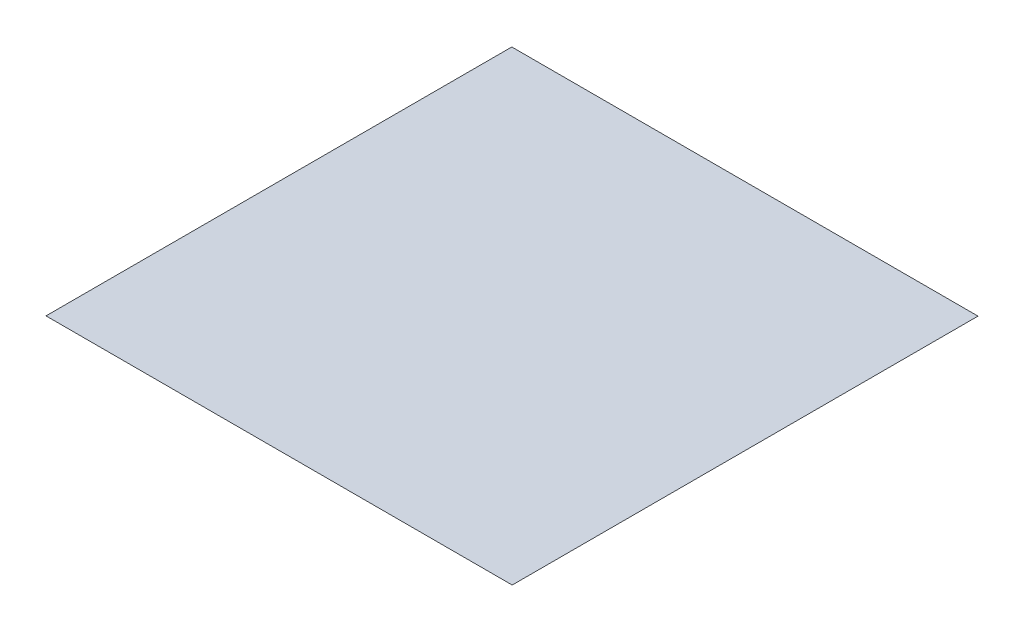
from build123d import *

# Parameters (mm, degrees)
SKETCH5_W      = 1056.30152692
SKETCH5_H      = 1052.286443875
EXTRUDE1_DEPTH = 441.706


with BuildPart() as part:
    # Sketch5 → Extrude1 (new body)
    with BuildSketch(Plane(origin=(0, 355.6, 0), x_dir=(-1, 0, 0), z_dir=(0, 1, 0))):
        with Locations((25.026770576, -16.407759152)):
            Rectangle(SKETCH5_W, SKETCH5_H)
    extrude(amount=-EXTRUDE1_DEPTH)

    # SurfaceCut1
    split(bisect_by=Plane(origin=(0, 1.591427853, 1.578702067), x_dir=(-1, 0, 0), z_dir=(3.632561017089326e-15, 0.7099395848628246, 0.7042625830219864)), keep=Keep.TOP)

    # SurfaceCut2
    split(bisect_by=Plane(origin=(0, 0, 0), x_dir=(-0.7071067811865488, 0.7071067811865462, 0), z_dir=(0.7071067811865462, 0.7071067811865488, 0)), keep=Keep.TOP)

    # SurfaceCut3
    split(bisect_by=Plane(origin=(0, 1.591427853, -1.578702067), x_dir=(-1, 0, 0), z_dir=(-3.372512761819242e-15, 0.7099395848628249, -0.7042625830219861)), keep=Keep.TOP)

    # SurfaceCut4
    split(bisect_by=Plane(origin=(0, 0, 0), x_dir=(-0.7071067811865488, -0.7071067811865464, 0), z_dir=(-0.7071067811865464, 0.7071067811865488, 0)), keep=Keep.TOP)


solid = part.part
